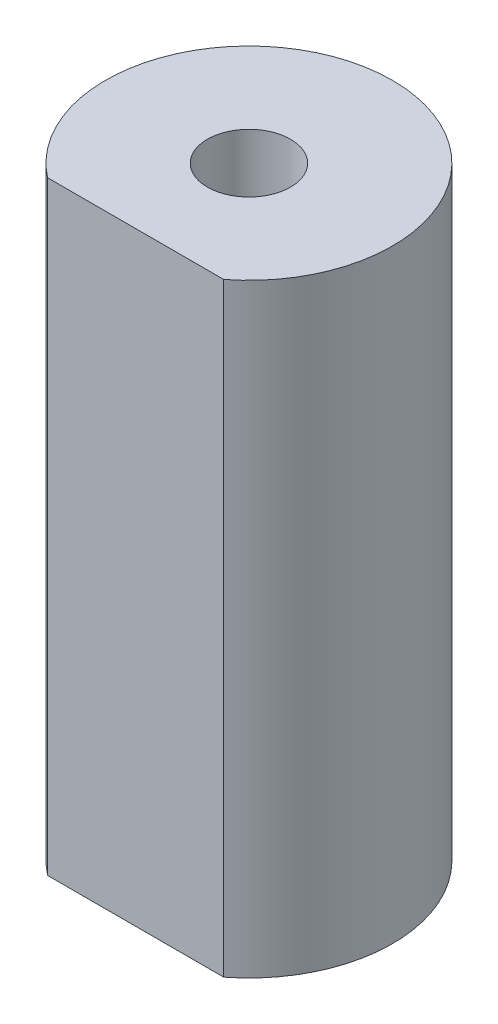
from build123d import *

# Parameters (mm, degrees)
SKETCH3_R      = 2.75
EXTRUDE1_DEPTH = 40


with BuildPart() as part:
    # Sketch3 → Extrude1 (new body)
    with BuildSketch(Plane(origin=(0, 0, 0), x_dir=(1, 0, 0), z_dir=(0, 1, 0))):
        with BuildLine():
            Line((5.830951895, -7.5), (-5.830951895, -7.5))
            ThreePointArc((-5.830951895, -7.5), (0, 9.5), (5.830951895, -7.5))
        make_face()
        with Locations(Location((0, 0, 0), (0, 0, 270))):
            Circle(SKETCH3_R, mode=Mode.SUBTRACT)
    extrude(amount=EXTRUDE1_DEPTH)


solid = part.part
